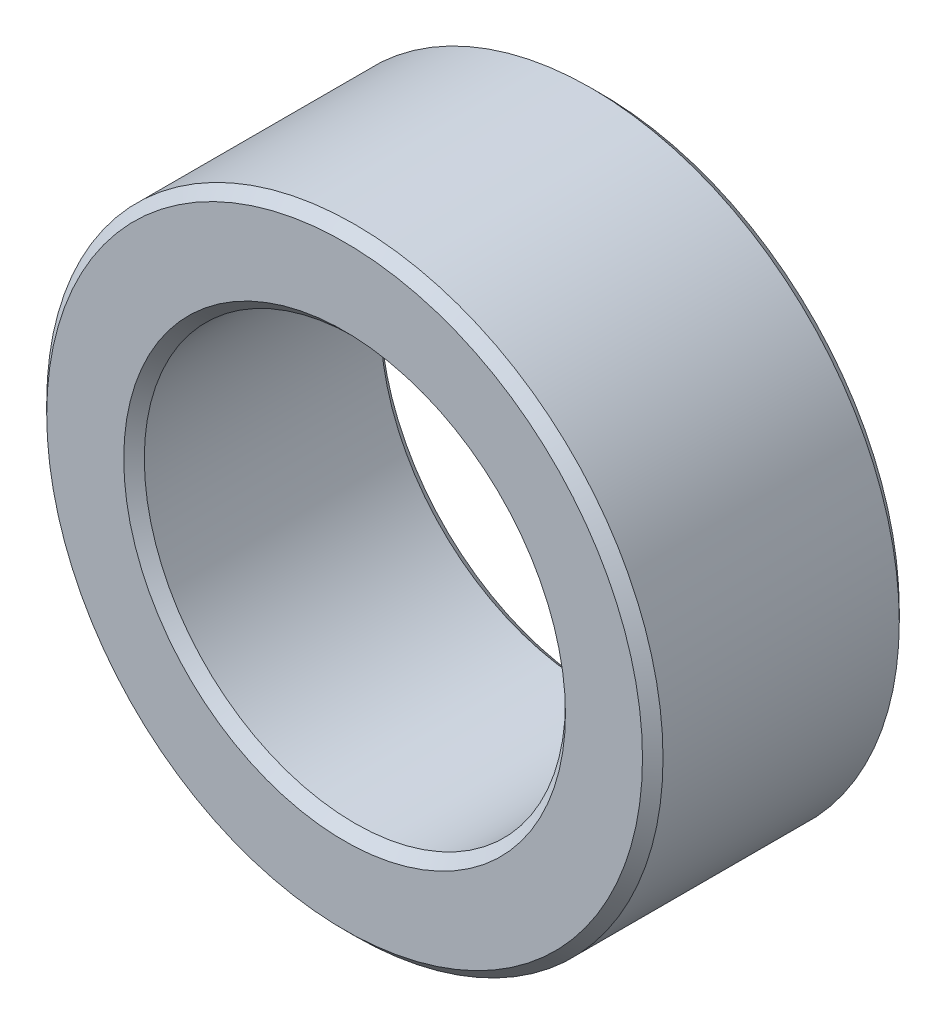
ISO-10303-21;
HEADER;
FILE_DESCRIPTION(('STEP AP214'),'2;1');
FILE_NAME('part.step','',(''),(''),'','','');
FILE_SCHEMA(('AUTOMOTIVE_DESIGN { 1 0 10303 214 1 1 1 1 }'));
ENDSEC;
DATA;
#1=APPLICATION_CONTEXT('core data for automotive mechanical design processes');
#2=APPLICATION_PROTOCOL_DEFINITION('international standard','automotive_design',2000,#1);
#3=PRODUCT_CONTEXT('',#1,'mechanical');
#4=PRODUCT('Part','Part','',(#3));
#5=PRODUCT_RELATED_PRODUCT_CATEGORY('part','',(#4));
#6=PRODUCT_DEFINITION_FORMATION('','',#4);
#7=PRODUCT_DEFINITION_CONTEXT('part definition',#1,'design');
#8=PRODUCT_DEFINITION('design','',#6,#7);
#9=PRODUCT_DEFINITION_SHAPE('','',#8);
#10=(LENGTH_UNIT() NAMED_UNIT(*) SI_UNIT(.MILLI.,.METRE.));
#11=(NAMED_UNIT(*) PLANE_ANGLE_UNIT() SI_UNIT($,.RADIAN.));
#12=(NAMED_UNIT(*) SI_UNIT($,.STERADIAN.) SOLID_ANGLE_UNIT());
#13=UNCERTAINTY_MEASURE_WITH_UNIT(LENGTH_MEASURE(1.E-05),#10,'distance_accuracy_value','');
#14=(GEOMETRIC_REPRESENTATION_CONTEXT(3) GLOBAL_UNCERTAINTY_ASSIGNED_CONTEXT((#13)) GLOBAL_UNIT_ASSIGNED_CONTEXT((#10,
#11,#12)) REPRESENTATION_CONTEXT('',''));
#15=CARTESIAN_POINT('',(0.,0.,0.));
#16=DIRECTION('',(0.,0.,1.));
#17=DIRECTION('',(1.,0.,0.));
#18=AXIS2_PLACEMENT_3D('',#15,#16,#17);
#19=CARTESIAN_POINT('',(0.,0.,2.5));
#20=DIRECTION('',(0.,0.,1.));
#21=DIRECTION('',(1.,0.,0.));
#22=AXIS2_PLACEMENT_3D('',#19,#20,#21);
#23=PLANE('',#22);
#24=CARTESIAN_POINT('',(0.,0.,2.5));
#25=DIRECTION('',(0.,0.,1.));
#26=DIRECTION('',(1.,0.,0.));
#27=AXIS2_PLACEMENT_3D('',#24,#25,#26);
#28=CIRCLE('',#27,4.3);
#29=CARTESIAN_POINT('',(4.3,0.,2.5));
#30=VERTEX_POINT('',#29);
#31=EDGE_CURVE('E10',#30,#30,#28,.F.);
#32=ORIENTED_EDGE('',*,*,#31,.T.);
#33=EDGE_LOOP('',(#32));
#34=FACE_BOUND('',#33,.T.);
#35=CARTESIAN_POINT('',(0.,0.,2.5));
#36=DIRECTION('',(0.,0.,1.));
#37=DIRECTION('',(1.,0.,0.));
#38=AXIS2_PLACEMENT_3D('',#35,#36,#37);
#39=CIRCLE('',#38,5.8);
#40=CARTESIAN_POINT('',(5.8,0.,2.5));
#41=VERTEX_POINT('',#40);
#42=EDGE_CURVE('E45',#41,#41,#39,.T.);
#43=ORIENTED_EDGE('',*,*,#42,.T.);
#44=EDGE_LOOP('',(#43));
#45=FACE_BOUND('',#44,.T.);
#46=ADVANCED_FACE('F37',(#34,#45),#23,.T.);
#47=CARTESIAN_POINT('',(0.,0.,-2.5));
#48=DIRECTION('',(0.,0.,1.));
#49=DIRECTION('',(1.,0.,0.));
#50=AXIS2_PLACEMENT_3D('',#47,#48,#49);
#51=PLANE('',#50);
#52=CARTESIAN_POINT('',(0.,0.,-2.5));
#53=DIRECTION('',(0.,0.,1.));
#54=DIRECTION('',(1.,0.,0.));
#55=AXIS2_PLACEMENT_3D('',#52,#53,#54);
#56=CIRCLE('',#55,5.8);
#57=CARTESIAN_POINT('',(5.8,0.,-2.5));
#58=VERTEX_POINT('',#57);
#59=EDGE_CURVE('E63',#58,#58,#56,.F.);
#60=ORIENTED_EDGE('',*,*,#59,.T.);
#61=EDGE_LOOP('',(#60));
#62=FACE_BOUND('',#61,.T.);
#63=CARTESIAN_POINT('',(0.,0.,-2.5));
#64=DIRECTION('',(0.,0.,1.));
#65=DIRECTION('',(1.,0.,0.));
#66=AXIS2_PLACEMENT_3D('',#63,#64,#65);
#67=CIRCLE('',#66,4.3);
#68=CARTESIAN_POINT('',(4.3,0.,-2.5));
#69=VERTEX_POINT('',#68);
#70=EDGE_CURVE('E67',#69,#69,#67,.T.);
#71=ORIENTED_EDGE('',*,*,#70,.T.);
#72=EDGE_LOOP('',(#71));
#73=FACE_BOUND('',#72,.T.);
#74=ADVANCED_FACE('F89',(#62,#73),#51,.F.);
#75=CARTESIAN_POINT('',(0.,0.,2.5));
#76=DIRECTION('',(0.,0.,-1.));
#77=DIRECTION('',(-1.,0.,0.));
#78=AXIS2_PLACEMENT_3D('',#75,#76,#77);
#79=CYLINDRICAL_SURFACE('',#78,6.);
#80=CARTESIAN_POINT('',(0.,0.,-2.3));
#81=DIRECTION('',(0.,0.,1.));
#82=DIRECTION('',(1.,0.,0.));
#83=AXIS2_PLACEMENT_3D('',#80,#81,#82);
#84=CIRCLE('',#83,6.);
#85=CARTESIAN_POINT('',(6.,0.,-2.3));
#86=VERTEX_POINT('',#85);
#87=EDGE_CURVE('E71',#86,#86,#84,.T.);
#88=ORIENTED_EDGE('',*,*,#87,.T.);
#89=EDGE_LOOP('',(#88));
#90=FACE_BOUND('',#89,.T.);
#91=CARTESIAN_POINT('',(0.,0.,2.3));
#92=DIRECTION('',(0.,0.,1.));
#93=DIRECTION('',(1.,0.,0.));
#94=AXIS2_PLACEMENT_3D('',#91,#92,#93);
#95=CIRCLE('',#94,6.);
#96=CARTESIAN_POINT('',(6.,0.,2.3));
#97=VERTEX_POINT('',#96);
#98=EDGE_CURVE('E74',#97,#97,#95,.F.);
#99=ORIENTED_EDGE('',*,*,#98,.T.);
#100=EDGE_LOOP('',(#99));
#101=FACE_BOUND('',#100,.T.);
#102=ADVANCED_FACE('F78',(#90,#101),#79,.T.);
#103=CARTESIAN_POINT('',(0.,0.,2.5));
#104=DIRECTION('',(0.,0.,-1.));
#105=DIRECTION('',(-1.,0.,0.));
#106=AXIS2_PLACEMENT_3D('',#103,#104,#105);
#107=CYLINDRICAL_SURFACE('',#106,4.1);
#108=CARTESIAN_POINT('',(0.,0.,-2.3));
#109=DIRECTION('',(0.,0.,1.));
#110=DIRECTION('',(1.,0.,0.));
#111=AXIS2_PLACEMENT_3D('',#108,#109,#110);
#112=CIRCLE('',#111,4.1);
#113=CARTESIAN_POINT('',(4.1,0.,-2.3));
#114=VERTEX_POINT('',#113);
#115=EDGE_CURVE('E52',#114,#114,#112,.F.);
#116=ORIENTED_EDGE('',*,*,#115,.T.);
#117=EDGE_LOOP('',(#116));
#118=FACE_BOUND('',#117,.T.);
#119=CARTESIAN_POINT('',(0.,0.,2.3));
#120=DIRECTION('',(0.,0.,1.));
#121=DIRECTION('',(1.,0.,0.));
#122=AXIS2_PLACEMENT_3D('',#119,#120,#121);
#123=CIRCLE('',#122,4.1);
#124=CARTESIAN_POINT('',(4.1,0.,2.3));
#125=VERTEX_POINT('',#124);
#126=EDGE_CURVE('E58',#125,#125,#123,.T.);
#127=ORIENTED_EDGE('',*,*,#126,.T.);
#128=EDGE_LOOP('',(#127));
#129=FACE_BOUND('',#128,.T.);
#130=ADVANCED_FACE('F97',(#118,#129),#107,.F.);
#131=CARTESIAN_POINT('',(0.,0.,-2.3));
#132=DIRECTION('',(0.,0.,1.));
#133=DIRECTION('',(1.,0.,0.));
#134=AXIS2_PLACEMENT_3D('',#131,#132,#133);
#135=CONICAL_SURFACE('',#134,6.,0.785398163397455);
#136=CARTESIAN_POINT('',(5.8,0.,-2.5));
#137=CARTESIAN_POINT('',(5.80208333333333,0.,-2.49791666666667));
#138=CARTESIAN_POINT('',(5.80416666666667,0.,-2.49583333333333));
#139=CARTESIAN_POINT('',(5.80833333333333,0.,-2.49166666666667));
#140=CARTESIAN_POINT('',(5.81041666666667,0.,-2.48958333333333));
#141=CARTESIAN_POINT('',(5.81458333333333,0.,-2.48541666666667));
#142=CARTESIAN_POINT('',(5.81666666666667,0.,-2.48333333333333));
#143=CARTESIAN_POINT('',(5.82083333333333,0.,-2.47916666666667));
#144=CARTESIAN_POINT('',(5.82291666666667,0.,-2.47708333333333));
#145=CARTESIAN_POINT('',(5.82708333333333,0.,-2.47291666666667));
#146=CARTESIAN_POINT('',(5.82916666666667,0.,-2.47083333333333));
#147=CARTESIAN_POINT('',(5.83333333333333,0.,-2.46666666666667));
#148=CARTESIAN_POINT('',(5.83541666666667,0.,-2.46458333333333));
#149=CARTESIAN_POINT('',(5.83958333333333,0.,-2.46041666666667));
#150=CARTESIAN_POINT('',(5.84166666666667,0.,-2.45833333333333));
#151=CARTESIAN_POINT('',(5.84583333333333,0.,-2.45416666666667));
#152=CARTESIAN_POINT('',(5.84791666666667,0.,-2.45208333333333));
#153=CARTESIAN_POINT('',(5.85208333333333,0.,-2.44791666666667));
#154=CARTESIAN_POINT('',(5.85416666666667,0.,-2.44583333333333));
#155=CARTESIAN_POINT('',(5.85833333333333,0.,-2.44166666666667));
#156=CARTESIAN_POINT('',(5.86041666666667,0.,-2.43958333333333));
#157=CARTESIAN_POINT('',(5.86458333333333,0.,-2.43541666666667));
#158=CARTESIAN_POINT('',(5.86666666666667,0.,-2.43333333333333));
#159=CARTESIAN_POINT('',(5.87083333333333,0.,-2.42916666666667));
#160=CARTESIAN_POINT('',(5.87291666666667,0.,-2.42708333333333));
#161=CARTESIAN_POINT('',(5.87708333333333,0.,-2.42291666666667));
#162=CARTESIAN_POINT('',(5.87916666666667,0.,-2.42083333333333));
#163=CARTESIAN_POINT('',(5.88333333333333,0.,-2.41666666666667));
#164=CARTESIAN_POINT('',(5.88541666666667,0.,-2.41458333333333));
#165=CARTESIAN_POINT('',(5.88958333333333,0.,-2.41041666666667));
#166=CARTESIAN_POINT('',(5.89166666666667,0.,-2.40833333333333));
#167=CARTESIAN_POINT('',(5.89583333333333,0.,-2.40416666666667));
#168=CARTESIAN_POINT('',(5.89791666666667,0.,-2.40208333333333));
#169=CARTESIAN_POINT('',(5.90208333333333,0.,-2.39791666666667));
#170=CARTESIAN_POINT('',(5.90416666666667,0.,-2.39583333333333));
#171=CARTESIAN_POINT('',(5.90833333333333,0.,-2.39166666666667));
#172=CARTESIAN_POINT('',(5.91041666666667,0.,-2.38958333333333));
#173=CARTESIAN_POINT('',(5.91458333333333,0.,-2.38541666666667));
#174=CARTESIAN_POINT('',(5.91666666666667,0.,-2.38333333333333));
#175=CARTESIAN_POINT('',(5.92083333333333,0.,-2.37916666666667));
#176=CARTESIAN_POINT('',(5.92291666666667,0.,-2.37708333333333));
#177=CARTESIAN_POINT('',(5.92708333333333,0.,-2.37291666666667));
#178=CARTESIAN_POINT('',(5.92916666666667,0.,-2.37083333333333));
#179=CARTESIAN_POINT('',(5.93333333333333,0.,-2.36666666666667));
#180=CARTESIAN_POINT('',(5.93541666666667,0.,-2.36458333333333));
#181=CARTESIAN_POINT('',(5.93958333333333,0.,-2.36041666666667));
#182=CARTESIAN_POINT('',(5.94166666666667,0.,-2.35833333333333));
#183=CARTESIAN_POINT('',(5.94583333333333,0.,-2.35416666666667));
#184=CARTESIAN_POINT('',(5.94791666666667,0.,-2.35208333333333));
#185=CARTESIAN_POINT('',(5.95208333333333,0.,-2.34791666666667));
#186=CARTESIAN_POINT('',(5.95416666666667,0.,-2.34583333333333));
#187=CARTESIAN_POINT('',(5.95833333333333,0.,-2.34166666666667));
#188=CARTESIAN_POINT('',(5.96041666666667,0.,-2.33958333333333));
#189=CARTESIAN_POINT('',(5.96458333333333,0.,-2.33541666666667));
#190=CARTESIAN_POINT('',(5.96666666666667,0.,-2.33333333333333));
#191=CARTESIAN_POINT('',(5.97083333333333,0.,-2.32916666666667));
#192=CARTESIAN_POINT('',(5.97291666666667,0.,-2.32708333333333));
#193=CARTESIAN_POINT('',(5.97708333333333,0.,-2.32291666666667));
#194=CARTESIAN_POINT('',(5.97916666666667,0.,-2.32083333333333));
#195=CARTESIAN_POINT('',(5.98333333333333,0.,-2.31666666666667));
#196=CARTESIAN_POINT('',(5.98541666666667,0.,-2.31458333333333));
#197=CARTESIAN_POINT('',(5.98958333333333,0.,-2.31041666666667));
#198=CARTESIAN_POINT('',(5.99166666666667,0.,-2.30833333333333));
#199=CARTESIAN_POINT('',(5.99583333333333,0.,-2.30416666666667));
#200=CARTESIAN_POINT('',(5.99791666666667,0.,-2.30208333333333));
#201=CARTESIAN_POINT('',(6.,0.,-2.3));
#202=B_SPLINE_CURVE_WITH_KNOTS('',3,(#136,#137,#138,#139,#140,#141,#142,#143,#144,#145,#146,
#147,#148,#149,#150,#151,#152,#153,#154,#155,#156,#157,#158,#159,#160,#161,#162,#163,#164,#165,
#166,#167,#168,#169,#170,#171,#172,#173,#174,#175,#176,#177,#178,#179,#180,#181,#182,#183,#184,
#185,#186,#187,#188,#189,#190,#191,#192,#193,#194,#195,#196,#197,#198,#199,#200,#201),
.UNSPECIFIED.,.F.,.F.,(4,2,2,2,2,2,2,2,2,2,2,2,2,2,2,2,2,2,2,2,2,2,2,2,2,2,2,2,2,2,2,2,4),(0.,
0.00883883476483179,0.0176776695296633,0.0265165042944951,0.0353553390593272,0.0441941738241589,
0.053033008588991,0.0618718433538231,0.0707106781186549,0.079549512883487,0.0883883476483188,
0.0972271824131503,0.106066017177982,0.114904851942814,0.123743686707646,0.132582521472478,
0.14142135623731,0.150260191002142,0.159099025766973,0.167937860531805,0.176776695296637,
0.185615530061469,0.194454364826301,0.203293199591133,0.212132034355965,0.220970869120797,
0.229809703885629,0.238648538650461,0.247487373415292,0.256326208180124,0.265165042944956,
0.274003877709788,0.28284271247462),.UNSPECIFIED.);
#203=EDGE_CURVE('BSEAM102',#58,#86,#202,.T.);
#204=ORIENTED_EDGE('',*,*,#59,.F.);
#205=ORIENTED_EDGE('',*,*,#87,.F.);
#206=ORIENTED_EDGE('',*,*,#203,.T.);
#207=ORIENTED_EDGE('',*,*,#203,.F.);
#208=EDGE_LOOP('',(#204,#206,#205,#207));
#209=FACE_BOUND('',#208,.T.);
#210=ADVANCED_FACE('F102',(#209),#135,.T.);
#211=CARTESIAN_POINT('',(0.,0.,-2.5));
#212=DIRECTION('',(0.,0.,-1.));
#213=DIRECTION('',(-1.,0.,0.));
#214=AXIS2_PLACEMENT_3D('',#211,#212,#213);
#215=CONICAL_SURFACE('',#214,4.3,0.785398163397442);
#216=ORIENTED_EDGE('',*,*,#115,.F.);
#217=EDGE_LOOP('',(#216));
#218=FACE_BOUND('',#217,.T.);
#219=ORIENTED_EDGE('',*,*,#70,.F.);
#220=EDGE_LOOP('',(#219));
#221=FACE_BOUND('',#220,.T.);
#222=ADVANCED_FACE('F86',(#218,#221),#215,.F.);
#223=CARTESIAN_POINT('',(0.,0.,2.3));
#224=DIRECTION('',(0.,0.,1.));
#225=DIRECTION('',(1.,0.,0.));
#226=AXIS2_PLACEMENT_3D('',#223,#224,#225);
#227=CONICAL_SURFACE('',#226,4.1,0.78539816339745);
#228=ORIENTED_EDGE('',*,*,#31,.F.);
#229=EDGE_LOOP('',(#228));
#230=FACE_BOUND('',#229,.T.);
#231=ORIENTED_EDGE('',*,*,#126,.F.);
#232=EDGE_LOOP('',(#231));
#233=FACE_BOUND('',#232,.T.);
#234=ADVANCED_FACE('F82',(#230,#233),#227,.F.);
#235=CARTESIAN_POINT('',(0.,0.,2.5));
#236=DIRECTION('',(0.,0.,-1.));
#237=DIRECTION('',(-1.,0.,0.));
#238=AXIS2_PLACEMENT_3D('',#235,#236,#237);
#239=CONICAL_SURFACE('',#238,5.8,0.785398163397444);
#240=ORIENTED_EDGE('',*,*,#98,.F.);
#241=EDGE_LOOP('',(#240));
#242=FACE_BOUND('',#241,.T.);
#243=ORIENTED_EDGE('',*,*,#42,.F.);
#244=EDGE_LOOP('',(#243));
#245=FACE_BOUND('',#244,.T.);
#246=ADVANCED_FACE('F39',(#242,#245),#239,.T.);
#247=CLOSED_SHELL('',(#46,#74,#102,#130,#210,#222,#234,#246));
#248=MANIFOLD_SOLID_BREP('B2',#247);
#249=ADVANCED_BREP_SHAPE_REPRESENTATION('',(#18,#248),#14);
#250=SHAPE_DEFINITION_REPRESENTATION(#9,#249);
ENDSEC;
END-ISO-10303-21;
